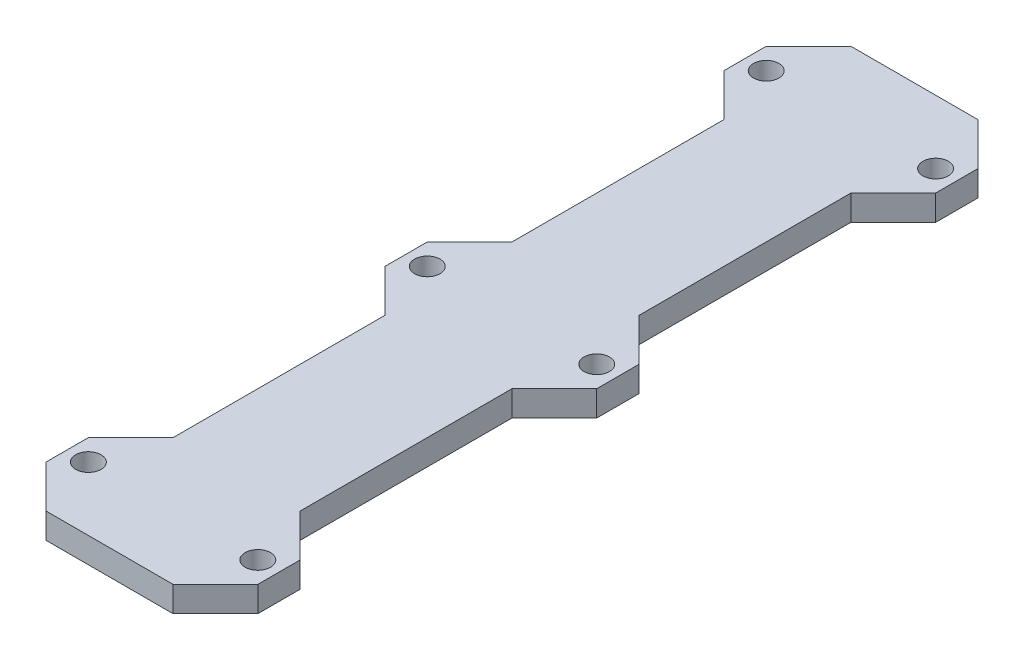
from build123d import *

# Parameters (mm, degrees)
CROQUIS1_R              = 1.5
SALIENTE_EXTRUIR1_DEPTH = 3


with BuildPart() as part:
    # Croquis1 → Saliente-Extruir1 (new body)
    with BuildSketch(Plane(origin=(0, 0, 0), x_dir=(1, 0, 0), z_dir=(0, 1, 0))):
        Polygon((-12.5, -2.5), (-12.5, 2.5), (-7.5, 7.5), (-7.5, 32.5), (-12.5, 37.5), (-12.5, 42.5), (-7.5, 47.5), (7.5, 47.5), (12.5, 42.5), (12.5, 37.5), (7.5, 32.5), (7.5, 7.5), (12.5, 2.5), (12.5, -2.5), (7.5, -7.5), (7.5, -32.5), (12.5, -37.5), (12.5, -42.5), (7.5, -47.5), (-7.5, -47.5), (-12.5, -42.5), (-12.5, -37.5), (-7.5, -32.5), (-7.5, -7.5), align=None)
        with Locations(Location((10, 40, 0), (0, 0, 270))):
            Circle(CROQUIS1_R, mode=Mode.SUBTRACT)
        with Locations(Location((10, 0, 0), (0, 0, 270))):
            Circle(CROQUIS1_R, mode=Mode.SUBTRACT)
        with Locations(Location((10, -40, 0), (0, 0, 270))):
            Circle(CROQUIS1_R, mode=Mode.SUBTRACT)
        with Locations(Location((-10, -40, 0), (0, 0, 90))):
            Circle(CROQUIS1_R, mode=Mode.SUBTRACT)
        with Locations(Location((-10, 40, 0), (0, 0, 90))):
            Circle(CROQUIS1_R, mode=Mode.SUBTRACT)
        with Locations(Location((-10, 0, 0), (0, 0, 90))):
            Circle(CROQUIS1_R, mode=Mode.SUBTRACT)
    extrude(amount=SALIENTE_EXTRUIR1_DEPTH)


solid = part.part
